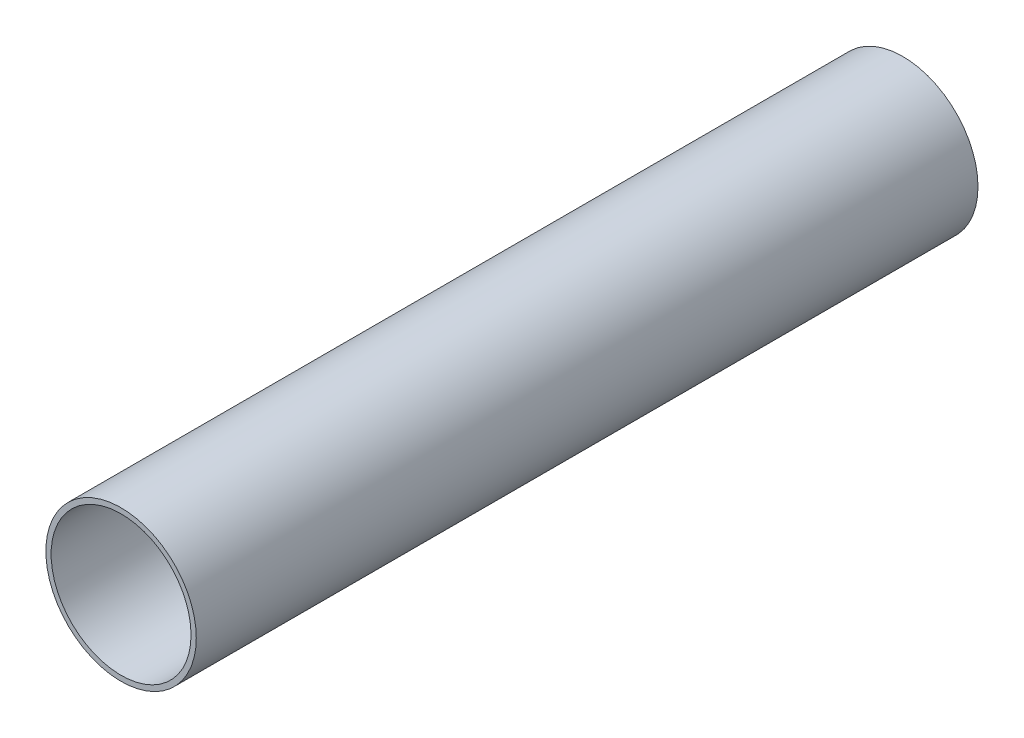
from build123d import *

# Parameters (mm, degrees)
SKETCH1_R      = 29.083
SKETCH1_R_2    = 27.051
EXTRUDE3_DEPTH = 302.26


with BuildPart() as part:
    # Sketch1 → Extrude3 (new body)
    with BuildSketch(Plane.XY):
        Circle(SKETCH1_R)
        Circle(SKETCH1_R_2, mode=Mode.SUBTRACT)
    extrude(amount=EXTRUDE3_DEPTH)


solid = part.part
